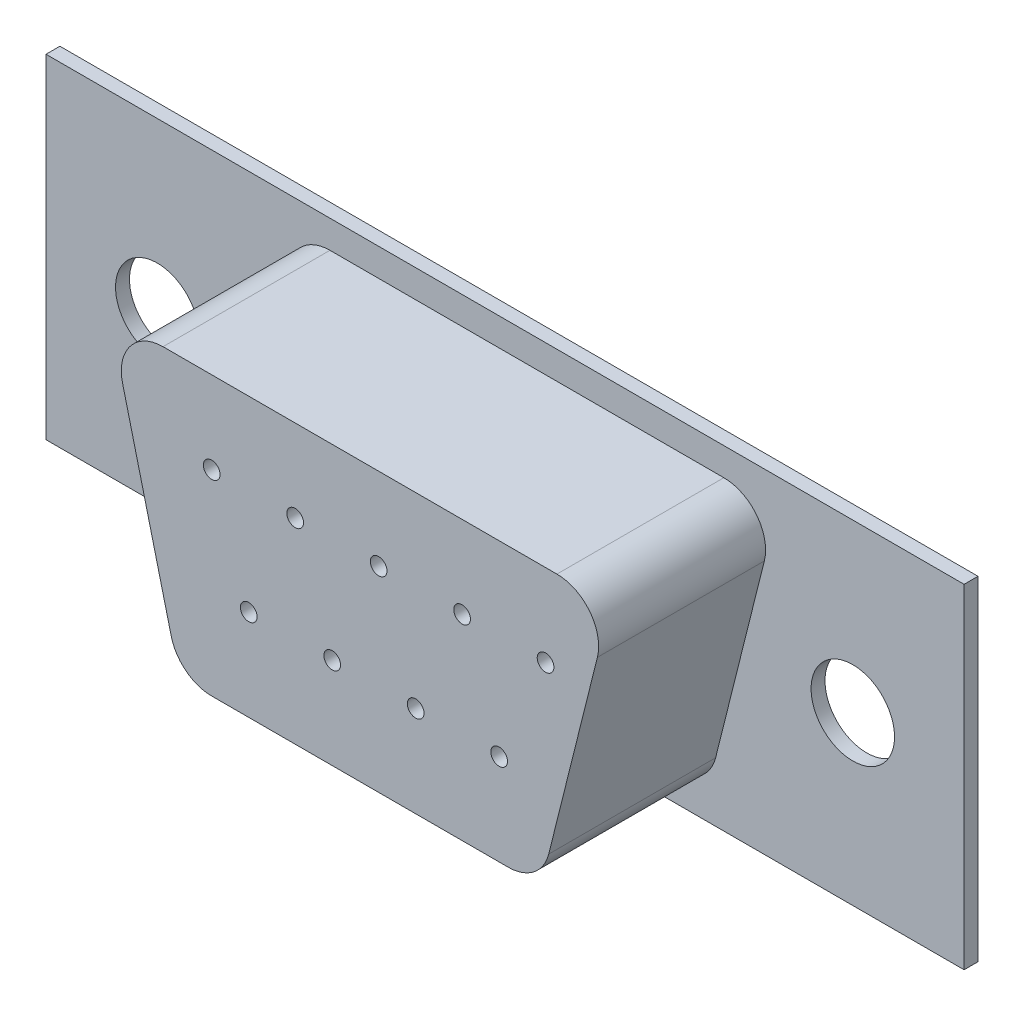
from build123d import *

# Parameters (mm, degrees)
ESQUISSE1_W      = 33
ESQUISSE1_H      = 12
ESQUISSE1_R      = 1.5
EXTRUSION1_DEPTH = 0.5
EXTRUSION2_DEPTH = 6
CONG_4_R         = 1.5
ESQUISSE3_R      = 0.3
EXTRUSION3_DEPTH = 19.553975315


with BuildPart() as part:
    # Esquisse1 → Extrusion1 (new body)
    with BuildSketch(Plane.XY):
        Rectangle(ESQUISSE1_W, ESQUISSE1_H)
        with Locations((-12.5, 0)):
            Circle(ESQUISSE1_R, mode=Mode.SUBTRACT)
        with Locations((12.5, 0)):
            Circle(ESQUISSE1_R, mode=Mode.SUBTRACT)
    extrude(amount=EXTRUSION1_DEPTH)

    # Esquisse2 → Extrusion2 (add)
    with BuildSketch(Plane.XY.offset(0.5)):
        Polygon((-8.214359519, 5), (9.785640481, 5), (7.285640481, -5), (-5.714359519, -5), align=None)
    extrude(amount=EXTRUSION2_DEPTH)

    # Cong_4
    cong_4_edges = [part.edges().sort_by_distance(p)[0] for p in [
        (-8.214359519, 5, 3.5),
        (-5.714359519, -5, 3.5),
        (7.285640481, -5, 3.5),
        (9.785640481, 5, 3.5),
    ]]
    fillet(cong_4_edges, radius=CONG_4_R)

    # Esquisse3 → Extrusion3 (cut, through all)
    with BuildSketch(Plane.XY.offset(0.5)):
        with Locations((-4.543137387, 2.042117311)):
            Circle(ESQUISSE3_R)
        with Locations((-1.543137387, 2.042117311)):
            Circle(ESQUISSE3_R)
        with Locations((1.456862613, 2.042117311)):
            Circle(ESQUISSE3_R)
        with Locations((4.456862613, 2.042117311)):
            Circle(ESQUISSE3_R)
        with Locations((7.456862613, 2.042117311)):
            Circle(ESQUISSE3_R)
        with Locations((-3.212319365, -1.720885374)):
            Circle(ESQUISSE3_R)
        with Locations((-0.212319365, -1.720885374)):
            Circle(ESQUISSE3_R)
        with Locations((2.787680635, -1.720885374)):
            Circle(ESQUISSE3_R)
        with Locations((5.787680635, -1.720885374)):
            Circle(ESQUISSE3_R)
    extrude(amount=EXTRUSION3_DEPTH, mode=Mode.SUBTRACT)


solid = part.part
